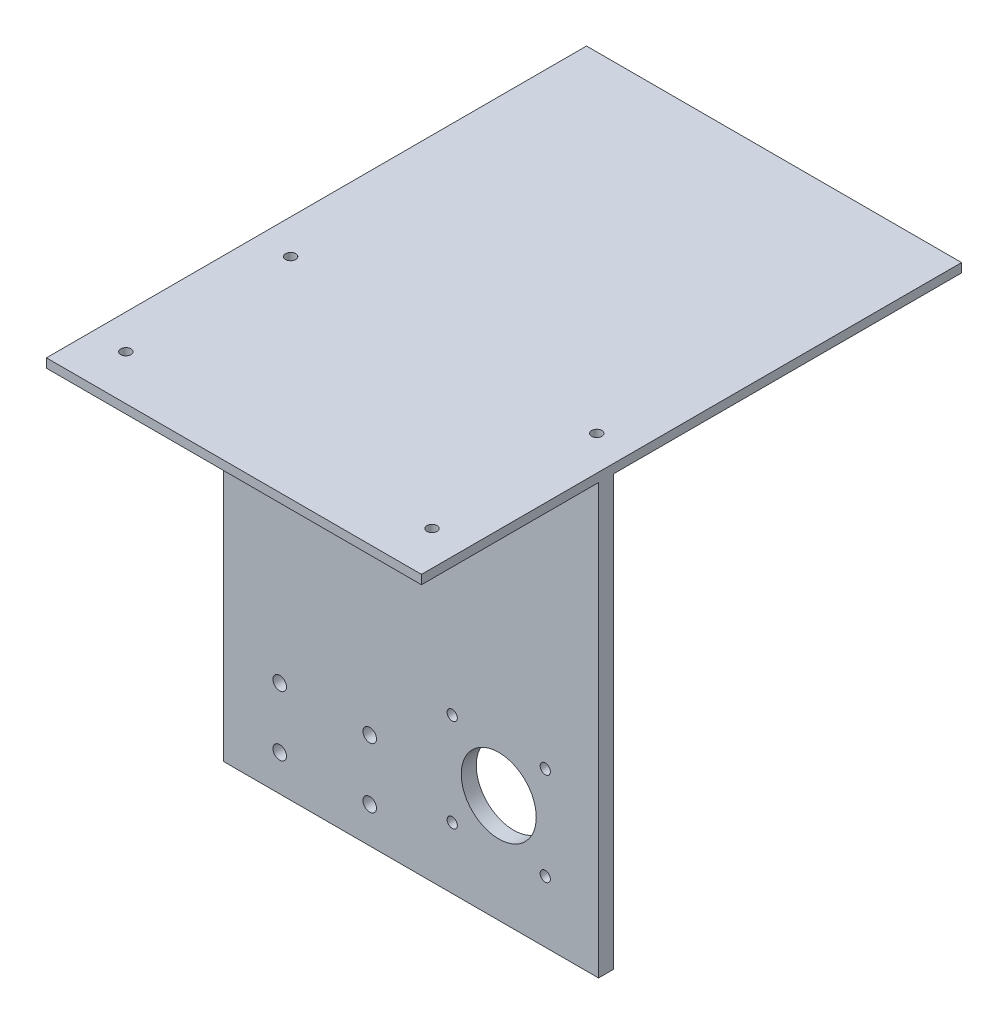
from build123d import *

# Parameters (mm, degrees)
SCHIZZO1_W                   = 125
SCHIZZO1_H                   = 140
ESTRUSIONE_ESTRUSIONE1_DEPTH = 5
FORO_PER_VITE_M4_1_D         = 4.5
FORO_PER_VITE_M3_2_D         = 3.4
SCHIZZO7_R                   = 11
TAGLIO_ESTRUSIONE1_DEPTH     = 94.974730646
SCHIZZO8_R                   = 12.5
TAGLIO_ESTRUSIONE2_DEPTH     = 94.974730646
SCHIZZO13_W                  = 125
SCHIZZO13_H                  = 5
ESTRUSIONE_ESTRUSIONE3_DEPTH = 3
SCHIZZO14_W                  = 125
SCHIZZO14_H                  = 180
ESTRUSIONE_ESTRUSIONE4_DEPTH = 3
FORO_PER_VITE_M3_3_D         = 3.4


with BuildPart() as part:
    # Schizzo1 → Estrusione-Estrusione1 (new body)
    with BuildSketch(Plane.XY):
        Rectangle(SCHIZZO1_W, SCHIZZO1_H)
    extrude(amount=ESTRUSIONE_ESTRUSIONE1_DEPTH)

    # Foro per Vite M4-1 (through all)
    with Locations(Plane.XY.offset(5)):
        with Locations((-43.75, -38), (-13.75, -38), (-43.75, -58), (-13.75, -58)):
            Hole(FORO_PER_VITE_M4_1_D / 2)

    # Foro per Vite M3-2 (through all)
    with Locations(Plane.XY.offset(5)):
        with Locations((13.75, -18.5), (44.75, -18.5), (13.75, -49.5), (44.75, -49.5), (-20.25, 53.990381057), (2.25, 41), (-20.25, 28.009618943)):
            Hole(FORO_PER_VITE_M3_2_D / 2)

    # Schizzo7 → Taglio-Estrusione1 (cut, through all)
    with BuildSketch(Plane.XY.offset(5)):
        with Locations((-12.75, 41)):
            Circle(SCHIZZO7_R)
    extrude(amount=-TAGLIO_ESTRUSIONE1_DEPTH, mode=Mode.SUBTRACT)

    # Schizzo8 → Taglio-Estrusione2 (cut, through all)
    with BuildSketch(Plane.XY.offset(5)):
        with Locations((29.25, -34)):
            Circle(SCHIZZO8_R)
    extrude(amount=-TAGLIO_ESTRUSIONE2_DEPTH, mode=Mode.SUBTRACT)

    # Schizzo13 → Estrusione-Estrusione3 (add)
    with BuildSketch(Plane(origin=(0, 70, 0), x_dir=(1, 0, 0), z_dir=(0, 1, 0))):
        with Locations((0, -2.5)):
            Rectangle(SCHIZZO13_W, SCHIZZO13_H)
    extrude(amount=ESTRUSIONE_ESTRUSIONE3_DEPTH)

    # Schizzo14 → Estrusione-Estrusione4 (add)
    with BuildSketch(Plane(origin=(0, 73, 0), x_dir=(1, 0, 0), z_dir=(0, 1, 0))):
        with Locations((0, 26)):
            Rectangle(SCHIZZO14_W, SCHIZZO14_H)
    extrude(amount=ESTRUSIONE_ESTRUSIONE4_DEPTH)

    # Foro per Vite M3-3 (through all)
    with Locations(Plane(origin=(0, 76, 0), x_dir=(1, 0, 0), z_dir=(0, 1, 0))):
        with Locations((-51.02, -49), (51.02, 5.9), (-51.02, 5.9), (51.02, -49)):
            Hole(FORO_PER_VITE_M3_3_D / 2)


solid = part.part
